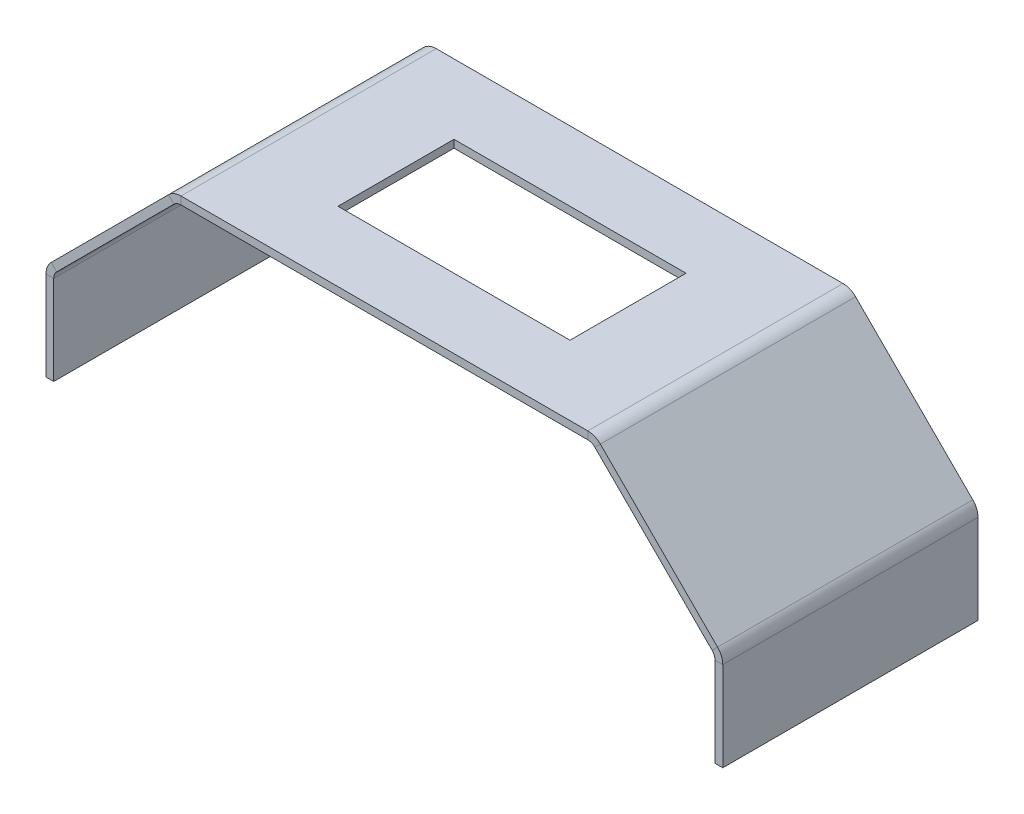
ISO-10303-21;
HEADER;
FILE_DESCRIPTION(('STEP AP214'),'2;1');
FILE_NAME('part.step','',(''),(''),'','','');
FILE_SCHEMA(('AUTOMOTIVE_DESIGN { 1 0 10303 214 1 1 1 1 }'));
ENDSEC;
DATA;
#1=APPLICATION_CONTEXT('core data for automotive mechanical design processes');
#2=APPLICATION_PROTOCOL_DEFINITION('international standard','automotive_design',2000,#1);
#3=PRODUCT_CONTEXT('',#1,'mechanical');
#4=PRODUCT('Part','Part','',(#3));
#5=PRODUCT_RELATED_PRODUCT_CATEGORY('part','',(#4));
#6=PRODUCT_DEFINITION_FORMATION('','',#4);
#7=PRODUCT_DEFINITION_CONTEXT('part definition',#1,'design');
#8=PRODUCT_DEFINITION('design','',#6,#7);
#9=PRODUCT_DEFINITION_SHAPE('','',#8);
#10=(LENGTH_UNIT() NAMED_UNIT(*) SI_UNIT(.MILLI.,.METRE.));
#11=(NAMED_UNIT(*) PLANE_ANGLE_UNIT() SI_UNIT($,.RADIAN.));
#12=(NAMED_UNIT(*) SI_UNIT($,.STERADIAN.) SOLID_ANGLE_UNIT());
#13=UNCERTAINTY_MEASURE_WITH_UNIT(LENGTH_MEASURE(1.E-05),#10,'distance_accuracy_value','');
#14=(GEOMETRIC_REPRESENTATION_CONTEXT(3) GLOBAL_UNCERTAINTY_ASSIGNED_CONTEXT((#13)) GLOBAL_UNIT_ASSIGNED_CONTEXT((#10,
#11,#12)) REPRESENTATION_CONTEXT('',''));
#15=CARTESIAN_POINT('',(0.,0.,0.));
#16=DIRECTION('',(0.,0.,1.));
#17=DIRECTION('',(1.,0.,0.));
#18=AXIS2_PLACEMENT_3D('',#15,#16,#17);
#19=CARTESIAN_POINT('',(1.34555144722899,26.345551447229,66.));
#20=DIRECTION('',(0.,0.,1.));
#21=DIRECTION('',(1.,0.,0.));
#22=AXIS2_PLACEMENT_3D('',#19,#20,#21);
#23=PLANE('',#22);
#24=DIRECTION('',(0.707106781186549,-0.707106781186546,0.));
#25=VECTOR('',#24,1.);
#26=CARTESIAN_POINT('',(1.34555144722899,26.345551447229,66.));
#27=LINE('',#26,#25);
#28=CARTESIAN_POINT('',(1.34555144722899,26.345551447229,66.));
#29=VERTEX_POINT('',#28);
#30=CARTESIAN_POINT('',(2.75976500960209,24.9313378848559,66.));
#31=VERTEX_POINT('',#30);
#32=EDGE_CURVE('E427',#29,#31,#27,.T.);
#33=ORIENTED_EDGE('',*,*,#32,.F.);
#34=CARTESIAN_POINT('',(4.594,23.097102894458,66.));
#35=DIRECTION('',(0.,0.,1.));
#36=DIRECTION('',(1.,0.,0.));
#37=AXIS2_PLACEMENT_3D('',#34,#35,#36);
#38=CIRCLE('',#37,4.594);
#39=CARTESIAN_POINT('',(0.,23.097102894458,66.));
#40=VERTEX_POINT('',#39);
#41=EDGE_CURVE('E250',#40,#29,#38,.F.);
#42=ORIENTED_EDGE('',*,*,#41,.F.);
#43=DIRECTION('',(-1.,0.,0.));
#44=VECTOR('',#43,1.);
#45=CARTESIAN_POINT('',(2.,23.097102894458,66.));
#46=LINE('',#45,#44);
#47=CARTESIAN_POINT('',(2.,23.097102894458,66.));
#48=VERTEX_POINT('',#47);
#49=EDGE_CURVE('E425',#48,#40,#46,.T.);
#50=ORIENTED_EDGE('',*,*,#49,.F.);
#51=CARTESIAN_POINT('',(4.594,23.097102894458,66.));
#52=DIRECTION('',(0.,0.,1.));
#53=DIRECTION('',(1.,0.,0.));
#54=AXIS2_PLACEMENT_3D('',#51,#52,#53);
#55=CIRCLE('',#54,2.594);
#56=EDGE_CURVE('E262',#48,#31,#55,.F.);
#57=ORIENTED_EDGE('',*,*,#56,.T.);
#58=EDGE_LOOP('',(#33,#42,#50,#57));
#59=FACE_BOUND('',#58,.T.);
#60=ADVANCED_FACE('F34',(#59),#23,.T.);
#61=CARTESIAN_POINT('',(2.,23.097102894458,66.));
#62=DIRECTION('',(0.,0.,1.));
#63=DIRECTION('',(1.,0.,0.));
#64=AXIS2_PLACEMENT_3D('',#61,#62,#63);
#65=PLANE('',#64);
#66=DIRECTION('',(0.707106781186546,0.707106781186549,0.));
#67=VECTOR('',#66,1.);
#68=CARTESIAN_POINT('',(0.,25.,66.));
#69=LINE('',#68,#67);
#70=CARTESIAN_POINT('',(31.6544485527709,56.654448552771,66.));
#71=VERTEX_POINT('',#70);
#72=EDGE_CURVE('E247',#29,#71,#69,.T.);
#73=ORIENTED_EDGE('',*,*,#72,.F.);
#74=ORIENTED_EDGE('',*,*,#32,.T.);
#75=DIRECTION('',(0.707106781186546,0.707106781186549,0.));
#76=VECTOR('',#75,1.);
#77=CARTESIAN_POINT('',(1.4142135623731,23.5857864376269,66.));
#78=LINE('',#77,#76);
#79=CARTESIAN_POINT('',(33.068662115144,55.2402349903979,66.));
#80=VERTEX_POINT('',#79);
#81=EDGE_CURVE('E265',#31,#80,#78,.T.);
#82=ORIENTED_EDGE('',*,*,#81,.T.);
#83=DIRECTION('',(-0.707106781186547,0.707106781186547,0.));
#84=VECTOR('',#83,1.);
#85=CARTESIAN_POINT('',(33.068662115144,55.2402349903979,66.));
#86=LINE('',#85,#84);
#87=EDGE_CURVE('E417',#80,#71,#86,.T.);
#88=ORIENTED_EDGE('',*,*,#87,.T.);
#89=EDGE_LOOP('',(#73,#74,#82,#88));
#90=FACE_BOUND('',#89,.T.);
#91=ADVANCED_FACE('F453',(#90),#65,.T.);
#92=CARTESIAN_POINT('',(0.,23.097102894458,0.));
#93=DIRECTION('',(0.,0.,-1.));
#94=DIRECTION('',(-1.,0.,0.));
#95=AXIS2_PLACEMENT_3D('',#92,#93,#94);
#96=PLANE('',#95);
#97=DIRECTION('',(1.,0.,0.));
#98=VECTOR('',#97,1.);
#99=CARTESIAN_POINT('',(0.,23.097102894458,0.));
#100=LINE('',#99,#98);
#101=CARTESIAN_POINT('',(0.,23.097102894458,0.));
#102=VERTEX_POINT('',#101);
#103=CARTESIAN_POINT('',(2.,23.097102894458,0.));
#104=VERTEX_POINT('',#103);
#105=EDGE_CURVE('E423',#102,#104,#100,.T.);
#106=ORIENTED_EDGE('',*,*,#105,.F.);
#107=CARTESIAN_POINT('',(4.594,23.097102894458,0.));
#108=DIRECTION('',(0.,0.,1.));
#109=DIRECTION('',(1.,0.,0.));
#110=AXIS2_PLACEMENT_3D('',#107,#108,#109);
#111=CIRCLE('',#110,4.594);
#112=CARTESIAN_POINT('',(1.34555144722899,26.345551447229,0.));
#113=VERTEX_POINT('',#112);
#114=EDGE_CURVE('E310',#102,#113,#111,.F.);
#115=ORIENTED_EDGE('',*,*,#114,.T.);
#116=DIRECTION('',(-0.707106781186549,0.707106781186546,0.));
#117=VECTOR('',#116,1.);
#118=CARTESIAN_POINT('',(2.75976500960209,24.9313378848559,0.));
#119=LINE('',#118,#117);
#120=CARTESIAN_POINT('',(2.75976500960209,24.9313378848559,0.));
#121=VERTEX_POINT('',#120);
#122=EDGE_CURVE('E421',#121,#113,#119,.T.);
#123=ORIENTED_EDGE('',*,*,#122,.F.);
#124=CARTESIAN_POINT('',(4.594,23.097102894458,0.));
#125=DIRECTION('',(0.,0.,1.));
#126=DIRECTION('',(1.,0.,0.));
#127=AXIS2_PLACEMENT_3D('',#124,#125,#126);
#128=CIRCLE('',#127,2.594);
#129=EDGE_CURVE('E322',#104,#121,#128,.F.);
#130=ORIENTED_EDGE('',*,*,#129,.F.);
#131=EDGE_LOOP('',(#106,#115,#123,#130));
#132=FACE_BOUND('',#131,.T.);
#133=ADVANCED_FACE('F458',(#132),#96,.T.);
#134=CARTESIAN_POINT('',(2.75976500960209,24.9313378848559,0.));
#135=DIRECTION('',(0.,0.,-1.));
#136=DIRECTION('',(-1.,0.,0.));
#137=AXIS2_PLACEMENT_3D('',#134,#135,#136);
#138=PLANE('',#137);
#139=DIRECTION('',(0.,1.,0.));
#140=VECTOR('',#139,1.);
#141=CARTESIAN_POINT('',(0.,0.,0.));
#142=LINE('',#141,#140);
#143=CARTESIAN_POINT('',(0.,0.,0.));
#144=VERTEX_POINT('',#143);
#145=EDGE_CURVE('E313',#144,#102,#142,.T.);
#146=ORIENTED_EDGE('',*,*,#145,.T.);
#147=ORIENTED_EDGE('',*,*,#105,.T.);
#148=DIRECTION('',(0.,1.,0.));
#149=VECTOR('',#148,1.);
#150=CARTESIAN_POINT('',(2.,0.,0.));
#151=LINE('',#150,#149);
#152=CARTESIAN_POINT('',(2.,0.,0.));
#153=VERTEX_POINT('',#152);
#154=EDGE_CURVE('E319',#153,#104,#151,.T.);
#155=ORIENTED_EDGE('',*,*,#154,.F.);
#156=DIRECTION('',(-1.,0.,0.));
#157=VECTOR('',#156,1.);
#158=CARTESIAN_POINT('',(2.,0.,0.));
#159=LINE('',#158,#157);
#160=EDGE_CURVE('E316',#153,#144,#159,.T.);
#161=ORIENTED_EDGE('',*,*,#160,.T.);
#162=EDGE_LOOP('',(#146,#147,#155,#161));
#163=FACE_BOUND('',#162,.T.);
#164=ADVANCED_FACE('F514',(#163),#138,.T.);
#165=CARTESIAN_POINT('',(34.9028971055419,58.,66.));
#166=DIRECTION('',(0.,0.,1.));
#167=DIRECTION('',(1.,0.,0.));
#168=AXIS2_PLACEMENT_3D('',#165,#166,#167);
#169=PLANE('',#168);
#170=DIRECTION('',(0.,-1.,0.));
#171=VECTOR('',#170,1.);
#172=CARTESIAN_POINT('',(34.9028971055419,58.,66.));
#173=LINE('',#172,#171);
#174=CARTESIAN_POINT('',(34.9028971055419,58.,66.));
#175=VERTEX_POINT('',#174);
#176=CARTESIAN_POINT('',(34.9028971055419,56.,66.));
#177=VERTEX_POINT('',#176);
#178=EDGE_CURVE('E419',#175,#177,#173,.T.);
#179=ORIENTED_EDGE('',*,*,#178,.F.);
#180=CARTESIAN_POINT('',(34.9028971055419,53.406,66.));
#181=DIRECTION('',(0.,0.,1.));
#182=DIRECTION('',(1.,0.,0.));
#183=AXIS2_PLACEMENT_3D('',#180,#181,#182);
#184=CIRCLE('',#183,4.594);
#185=EDGE_CURVE('E244',#71,#175,#184,.F.);
#186=ORIENTED_EDGE('',*,*,#185,.F.);
#187=ORIENTED_EDGE('',*,*,#87,.F.);
#188=CARTESIAN_POINT('',(34.9028971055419,53.406,66.));
#189=DIRECTION('',(0.,0.,1.));
#190=DIRECTION('',(1.,0.,0.));
#191=AXIS2_PLACEMENT_3D('',#188,#189,#190);
#192=CIRCLE('',#191,2.594);
#193=EDGE_CURVE('E268',#80,#177,#192,.F.);
#194=ORIENTED_EDGE('',*,*,#193,.T.);
#195=EDGE_LOOP('',(#179,#186,#187,#194));
#196=FACE_BOUND('',#195,.T.);
#197=ADVANCED_FACE('F502',(#196),#169,.T.);
#198=CARTESIAN_POINT('',(33.068662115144,55.2402349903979,66.));
#199=DIRECTION('',(0.,0.,1.));
#200=DIRECTION('',(1.,0.,0.));
#201=AXIS2_PLACEMENT_3D('',#198,#199,#200);
#202=PLANE('',#201);
#203=DIRECTION('',(1.,0.,0.));
#204=VECTOR('',#203,1.);
#205=CARTESIAN_POINT('',(32.9999999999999,58.,66.));
#206=LINE('',#205,#204);
#207=CARTESIAN_POINT('',(140.097102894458,58.,66.));
#208=VERTEX_POINT('',#207);
#209=EDGE_CURVE('E241',#175,#208,#206,.T.);
#210=ORIENTED_EDGE('',*,*,#209,.F.);
#211=ORIENTED_EDGE('',*,*,#178,.T.);
#212=DIRECTION('',(1.,0.,0.));
#213=VECTOR('',#212,1.);
#214=CARTESIAN_POINT('',(32.9999999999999,56.,66.));
#215=LINE('',#214,#213);
#216=CARTESIAN_POINT('',(140.097102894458,56.,66.));
#217=VERTEX_POINT('',#216);
#218=EDGE_CURVE('E271',#177,#217,#215,.T.);
#219=ORIENTED_EDGE('',*,*,#218,.T.);
#220=DIRECTION('',(0.,1.,0.));
#221=VECTOR('',#220,1.);
#222=CARTESIAN_POINT('',(140.097102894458,56.,66.));
#223=LINE('',#222,#221);
#224=EDGE_CURVE('E409',#217,#208,#223,.T.);
#225=ORIENTED_EDGE('',*,*,#224,.T.);
#226=EDGE_LOOP('',(#210,#211,#219,#225));
#227=FACE_BOUND('',#226,.T.);
#228=ADVANCED_FACE('F521',(#227),#202,.T.);
#229=CARTESIAN_POINT('',(31.6544485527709,56.654448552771,0.));
#230=DIRECTION('',(0.,0.,-1.));
#231=DIRECTION('',(-1.,0.,0.));
#232=AXIS2_PLACEMENT_3D('',#229,#230,#231);
#233=PLANE('',#232);
#234=DIRECTION('',(0.707106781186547,-0.707106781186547,0.));
#235=VECTOR('',#234,1.);
#236=CARTESIAN_POINT('',(31.6544485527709,56.654448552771,0.));
#237=LINE('',#236,#235);
#238=CARTESIAN_POINT('',(31.6544485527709,56.654448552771,0.));
#239=VERTEX_POINT('',#238);
#240=CARTESIAN_POINT('',(33.068662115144,55.2402349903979,0.));
#241=VERTEX_POINT('',#240);
#242=EDGE_CURVE('E415',#239,#241,#237,.T.);
#243=ORIENTED_EDGE('',*,*,#242,.F.);
#244=CARTESIAN_POINT('',(34.9028971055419,53.406,0.));
#245=DIRECTION('',(0.,0.,1.));
#246=DIRECTION('',(1.,0.,0.));
#247=AXIS2_PLACEMENT_3D('',#244,#245,#246);
#248=CIRCLE('',#247,4.594);
#249=CARTESIAN_POINT('',(34.9028971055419,58.,0.));
#250=VERTEX_POINT('',#249);
#251=EDGE_CURVE('E304',#239,#250,#248,.F.);
#252=ORIENTED_EDGE('',*,*,#251,.T.);
#253=DIRECTION('',(0.,1.,0.));
#254=VECTOR('',#253,1.);
#255=CARTESIAN_POINT('',(34.9028971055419,56.,0.));
#256=LINE('',#255,#254);
#257=CARTESIAN_POINT('',(34.9028971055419,56.,0.));
#258=VERTEX_POINT('',#257);
#259=EDGE_CURVE('E413',#258,#250,#256,.T.);
#260=ORIENTED_EDGE('',*,*,#259,.F.);
#261=CARTESIAN_POINT('',(34.9028971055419,53.406,0.));
#262=DIRECTION('',(0.,0.,1.));
#263=DIRECTION('',(1.,0.,0.));
#264=AXIS2_PLACEMENT_3D('',#261,#262,#263);
#265=CIRCLE('',#264,2.594);
#266=EDGE_CURVE('E328',#241,#258,#265,.F.);
#267=ORIENTED_EDGE('',*,*,#266,.F.);
#268=EDGE_LOOP('',(#243,#252,#260,#267));
#269=FACE_BOUND('',#268,.T.);
#270=ADVANCED_FACE('F527',(#269),#233,.T.);
#271=CARTESIAN_POINT('',(34.9028971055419,56.,0.));
#272=DIRECTION('',(0.,0.,-1.));
#273=DIRECTION('',(-1.,0.,0.));
#274=AXIS2_PLACEMENT_3D('',#271,#272,#273);
#275=PLANE('',#274);
#276=DIRECTION('',(0.707106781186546,0.707106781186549,0.));
#277=VECTOR('',#276,1.);
#278=CARTESIAN_POINT('',(0.,25.,0.));
#279=LINE('',#278,#277);
#280=EDGE_CURVE('E307',#113,#239,#279,.T.);
#281=ORIENTED_EDGE('',*,*,#280,.T.);
#282=ORIENTED_EDGE('',*,*,#242,.T.);
#283=DIRECTION('',(0.707106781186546,0.707106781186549,0.));
#284=VECTOR('',#283,1.);
#285=CARTESIAN_POINT('',(1.4142135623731,23.5857864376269,0.));
#286=LINE('',#285,#284);
#287=EDGE_CURVE('E325',#121,#241,#286,.T.);
#288=ORIENTED_EDGE('',*,*,#287,.F.);
#289=ORIENTED_EDGE('',*,*,#122,.T.);
#290=EDGE_LOOP('',(#281,#282,#288,#289));
#291=FACE_BOUND('',#290,.T.);
#292=ADVANCED_FACE('F511',(#291),#275,.T.);
#293=CARTESIAN_POINT('',(143.345551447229,56.654448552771,66.));
#294=DIRECTION('',(0.,0.,1.));
#295=DIRECTION('',(1.,0.,0.));
#296=AXIS2_PLACEMENT_3D('',#293,#294,#295);
#297=PLANE('',#296);
#298=DIRECTION('',(-0.707106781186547,-0.707106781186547,0.));
#299=VECTOR('',#298,1.);
#300=CARTESIAN_POINT('',(143.345551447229,56.654448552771,66.));
#301=LINE('',#300,#299);
#302=CARTESIAN_POINT('',(143.345551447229,56.654448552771,66.));
#303=VERTEX_POINT('',#302);
#304=CARTESIAN_POINT('',(141.931337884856,55.2402349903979,66.));
#305=VERTEX_POINT('',#304);
#306=EDGE_CURVE('E411',#303,#305,#301,.T.);
#307=ORIENTED_EDGE('',*,*,#306,.F.);
#308=CARTESIAN_POINT('',(140.097102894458,53.406,66.));
#309=DIRECTION('',(0.,0.,1.));
#310=DIRECTION('',(1.,0.,0.));
#311=AXIS2_PLACEMENT_3D('',#308,#309,#310);
#312=CIRCLE('',#311,4.594);
#313=EDGE_CURVE('E238',#208,#303,#312,.F.);
#314=ORIENTED_EDGE('',*,*,#313,.F.);
#315=ORIENTED_EDGE('',*,*,#224,.F.);
#316=CARTESIAN_POINT('',(140.097102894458,53.406,66.));
#317=DIRECTION('',(0.,0.,1.));
#318=DIRECTION('',(1.,0.,0.));
#319=AXIS2_PLACEMENT_3D('',#316,#317,#318);
#320=CIRCLE('',#319,2.594);
#321=EDGE_CURVE('E274',#217,#305,#320,.F.);
#322=ORIENTED_EDGE('',*,*,#321,.T.);
#323=EDGE_LOOP('',(#307,#314,#315,#322));
#324=FACE_BOUND('',#323,.T.);
#325=ADVANCED_FACE('F533',(#324),#297,.T.);
#326=CARTESIAN_POINT('',(140.097102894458,56.,66.));
#327=DIRECTION('',(0.,0.,1.));
#328=DIRECTION('',(1.,0.,0.));
#329=AXIS2_PLACEMENT_3D('',#326,#327,#328);
#330=PLANE('',#329);
#331=DIRECTION('',(0.707106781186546,-0.707106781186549,0.));
#332=VECTOR('',#331,1.);
#333=CARTESIAN_POINT('',(142.,58.,66.));
#334=LINE('',#333,#332);
#335=CARTESIAN_POINT('',(173.654448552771,26.345551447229,66.));
#336=VERTEX_POINT('',#335);
#337=EDGE_CURVE('E235',#303,#336,#334,.T.);
#338=ORIENTED_EDGE('',*,*,#337,.F.);
#339=ORIENTED_EDGE('',*,*,#306,.T.);
#340=DIRECTION('',(0.707106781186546,-0.707106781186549,0.));
#341=VECTOR('',#340,1.);
#342=CARTESIAN_POINT('',(140.585786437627,56.5857864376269,66.));
#343=LINE('',#342,#341);
#344=CARTESIAN_POINT('',(172.240234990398,24.9313378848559,66.));
#345=VERTEX_POINT('',#344);
#346=EDGE_CURVE('E277',#305,#345,#343,.T.);
#347=ORIENTED_EDGE('',*,*,#346,.T.);
#348=DIRECTION('',(0.707106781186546,0.707106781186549,0.));
#349=VECTOR('',#348,1.);
#350=CARTESIAN_POINT('',(172.240234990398,24.9313378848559,66.));
#351=LINE('',#350,#349);
#352=EDGE_CURVE('E401',#345,#336,#351,.T.);
#353=ORIENTED_EDGE('',*,*,#352,.T.);
#354=EDGE_LOOP('',(#338,#339,#347,#353));
#355=FACE_BOUND('',#354,.T.);
#356=ADVANCED_FACE('F536',(#355),#330,.T.);
#357=CARTESIAN_POINT('',(140.097102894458,58.,0.));
#358=DIRECTION('',(0.,0.,-1.));
#359=DIRECTION('',(-1.,0.,0.));
#360=AXIS2_PLACEMENT_3D('',#357,#358,#359);
#361=PLANE('',#360);
#362=DIRECTION('',(0.,-1.,0.));
#363=VECTOR('',#362,1.);
#364=CARTESIAN_POINT('',(140.097102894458,58.,0.));
#365=LINE('',#364,#363);
#366=CARTESIAN_POINT('',(140.097102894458,58.,0.));
#367=VERTEX_POINT('',#366);
#368=CARTESIAN_POINT('',(140.097102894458,56.,0.));
#369=VERTEX_POINT('',#368);
#370=EDGE_CURVE('E407',#367,#369,#365,.T.);
#371=ORIENTED_EDGE('',*,*,#370,.F.);
#372=CARTESIAN_POINT('',(140.097102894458,53.406,0.));
#373=DIRECTION('',(0.,0.,1.));
#374=DIRECTION('',(1.,0.,0.));
#375=AXIS2_PLACEMENT_3D('',#372,#373,#374);
#376=CIRCLE('',#375,4.594);
#377=CARTESIAN_POINT('',(143.345551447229,56.654448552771,0.));
#378=VERTEX_POINT('',#377);
#379=EDGE_CURVE('E298',#367,#378,#376,.F.);
#380=ORIENTED_EDGE('',*,*,#379,.T.);
#381=DIRECTION('',(0.707106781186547,0.707106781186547,0.));
#382=VECTOR('',#381,1.);
#383=CARTESIAN_POINT('',(141.931337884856,55.2402349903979,0.));
#384=LINE('',#383,#382);
#385=CARTESIAN_POINT('',(141.931337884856,55.2402349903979,0.));
#386=VERTEX_POINT('',#385);
#387=EDGE_CURVE('E405',#386,#378,#384,.T.);
#388=ORIENTED_EDGE('',*,*,#387,.F.);
#389=CARTESIAN_POINT('',(140.097102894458,53.406,0.));
#390=DIRECTION('',(0.,0.,1.));
#391=DIRECTION('',(1.,0.,0.));
#392=AXIS2_PLACEMENT_3D('',#389,#390,#391);
#393=CIRCLE('',#392,2.594);
#394=EDGE_CURVE('E334',#369,#386,#393,.F.);
#395=ORIENTED_EDGE('',*,*,#394,.F.);
#396=EDGE_LOOP('',(#371,#380,#388,#395));
#397=FACE_BOUND('',#396,.T.);
#398=ADVANCED_FACE('F540',(#397),#361,.T.);
#399=CARTESIAN_POINT('',(141.931337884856,55.2402349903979,0.));
#400=DIRECTION('',(0.,0.,-1.));
#401=DIRECTION('',(-1.,0.,0.));
#402=AXIS2_PLACEMENT_3D('',#399,#400,#401);
#403=PLANE('',#402);
#404=DIRECTION('',(1.,0.,0.));
#405=VECTOR('',#404,1.);
#406=CARTESIAN_POINT('',(32.9999999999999,58.,0.));
#407=LINE('',#406,#405);
#408=EDGE_CURVE('E301',#250,#367,#407,.T.);
#409=ORIENTED_EDGE('',*,*,#408,.T.);
#410=ORIENTED_EDGE('',*,*,#370,.T.);
#411=DIRECTION('',(1.,0.,0.));
#412=VECTOR('',#411,1.);
#413=CARTESIAN_POINT('',(32.9999999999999,56.,0.));
#414=LINE('',#413,#412);
#415=EDGE_CURVE('E331',#258,#369,#414,.T.);
#416=ORIENTED_EDGE('',*,*,#415,.F.);
#417=ORIENTED_EDGE('',*,*,#259,.T.);
#418=EDGE_LOOP('',(#409,#410,#416,#417));
#419=FACE_BOUND('',#418,.T.);
#420=ADVANCED_FACE('F544',(#419),#403,.T.);
#421=CARTESIAN_POINT('',(175.,23.097102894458,66.));
#422=DIRECTION('',(0.,0.,1.));
#423=DIRECTION('',(1.,0.,0.));
#424=AXIS2_PLACEMENT_3D('',#421,#422,#423);
#425=PLANE('',#424);
#426=DIRECTION('',(-1.,0.,0.));
#427=VECTOR('',#426,1.);
#428=CARTESIAN_POINT('',(175.,23.097102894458,66.));
#429=LINE('',#428,#427);
#430=CARTESIAN_POINT('',(175.,23.097102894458,66.));
#431=VERTEX_POINT('',#430);
#432=CARTESIAN_POINT('',(173.,23.097102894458,66.));
#433=VERTEX_POINT('',#432);
#434=EDGE_CURVE('E403',#431,#433,#429,.T.);
#435=ORIENTED_EDGE('',*,*,#434,.F.);
#436=CARTESIAN_POINT('',(170.406,23.097102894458,66.));
#437=DIRECTION('',(0.,0.,1.));
#438=DIRECTION('',(1.,0.,0.));
#439=AXIS2_PLACEMENT_3D('',#436,#437,#438);
#440=CIRCLE('',#439,4.594);
#441=EDGE_CURVE('E232',#336,#431,#440,.F.);
#442=ORIENTED_EDGE('',*,*,#441,.F.);
#443=ORIENTED_EDGE('',*,*,#352,.F.);
#444=CARTESIAN_POINT('',(170.406,23.097102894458,66.));
#445=DIRECTION('',(0.,0.,1.));
#446=DIRECTION('',(1.,0.,0.));
#447=AXIS2_PLACEMENT_3D('',#444,#445,#446);
#448=CIRCLE('',#447,2.594);
#449=EDGE_CURVE('E280',#345,#433,#448,.F.);
#450=ORIENTED_EDGE('',*,*,#449,.T.);
#451=EDGE_LOOP('',(#435,#442,#443,#450));
#452=FACE_BOUND('',#451,.T.);
#453=ADVANCED_FACE('F548',(#452),#425,.T.);
#454=CARTESIAN_POINT('',(172.240234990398,24.9313378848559,66.));
#455=DIRECTION('',(0.,0.,1.));
#456=DIRECTION('',(1.,0.,0.));
#457=AXIS2_PLACEMENT_3D('',#454,#455,#456);
#458=PLANE('',#457);
#459=DIRECTION('',(0.,-1.,0.));
#460=VECTOR('',#459,1.);
#461=CARTESIAN_POINT('',(175.,25.,66.));
#462=LINE('',#461,#460);
#463=CARTESIAN_POINT('',(175.,0.,66.));
#464=VERTEX_POINT('',#463);
#465=EDGE_CURVE('E229',#431,#464,#462,.T.);
#466=ORIENTED_EDGE('',*,*,#465,.F.);
#467=ORIENTED_EDGE('',*,*,#434,.T.);
#468=DIRECTION('',(0.,1.,0.));
#469=VECTOR('',#468,1.);
#470=CARTESIAN_POINT('',(173.,25.,66.));
#471=LINE('',#470,#469);
#472=CARTESIAN_POINT('',(173.,0.,66.));
#473=VERTEX_POINT('',#472);
#474=EDGE_CURVE('E223',#433,#473,#471,.F.);
#475=ORIENTED_EDGE('',*,*,#474,.T.);
#476=DIRECTION('',(-1.,0.,0.));
#477=VECTOR('',#476,1.);
#478=CARTESIAN_POINT('',(175.,0.,66.));
#479=LINE('',#478,#477);
#480=EDGE_CURVE('E225',#464,#473,#479,.T.);
#481=ORIENTED_EDGE('',*,*,#480,.F.);
#482=EDGE_LOOP('',(#466,#467,#475,#481));
#483=FACE_BOUND('',#482,.T.);
#484=ADVANCED_FACE('F552',(#483),#458,.T.);
#485=CARTESIAN_POINT('',(173.654448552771,26.345551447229,0.));
#486=DIRECTION('',(0.,0.,-1.));
#487=DIRECTION('',(-1.,0.,0.));
#488=AXIS2_PLACEMENT_3D('',#485,#486,#487);
#489=PLANE('',#488);
#490=DIRECTION('',(-0.707106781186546,-0.707106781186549,0.));
#491=VECTOR('',#490,1.);
#492=CARTESIAN_POINT('',(173.654448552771,26.345551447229,0.));
#493=LINE('',#492,#491);
#494=CARTESIAN_POINT('',(173.654448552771,26.345551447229,0.));
#495=VERTEX_POINT('',#494);
#496=CARTESIAN_POINT('',(172.240234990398,24.9313378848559,0.));
#497=VERTEX_POINT('',#496);
#498=EDGE_CURVE('E399',#495,#497,#493,.T.);
#499=ORIENTED_EDGE('',*,*,#498,.F.);
#500=CARTESIAN_POINT('',(170.406,23.097102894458,0.));
#501=DIRECTION('',(0.,0.,1.));
#502=DIRECTION('',(1.,0.,0.));
#503=AXIS2_PLACEMENT_3D('',#500,#501,#502);
#504=CIRCLE('',#503,4.594);
#505=CARTESIAN_POINT('',(175.,23.097102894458,0.));
#506=VERTEX_POINT('',#505);
#507=EDGE_CURVE('E292',#495,#506,#504,.F.);
#508=ORIENTED_EDGE('',*,*,#507,.T.);
#509=DIRECTION('',(1.,0.,0.));
#510=VECTOR('',#509,1.);
#511=CARTESIAN_POINT('',(173.,23.097102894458,0.));
#512=LINE('',#511,#510);
#513=CARTESIAN_POINT('',(173.,23.097102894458,0.));
#514=VERTEX_POINT('',#513);
#515=EDGE_CURVE('E397',#514,#506,#512,.T.);
#516=ORIENTED_EDGE('',*,*,#515,.F.);
#517=CARTESIAN_POINT('',(170.406,23.097102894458,0.));
#518=DIRECTION('',(0.,0.,1.));
#519=DIRECTION('',(1.,0.,0.));
#520=AXIS2_PLACEMENT_3D('',#517,#518,#519);
#521=CIRCLE('',#520,2.594);
#522=EDGE_CURVE('E226',#497,#514,#521,.F.);
#523=ORIENTED_EDGE('',*,*,#522,.F.);
#524=EDGE_LOOP('',(#499,#508,#516,#523));
#525=FACE_BOUND('',#524,.T.);
#526=ADVANCED_FACE('F556',(#525),#489,.T.);
#527=CARTESIAN_POINT('',(173.,23.097102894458,0.));
#528=DIRECTION('',(0.,0.,-1.));
#529=DIRECTION('',(-1.,0.,0.));
#530=AXIS2_PLACEMENT_3D('',#527,#528,#529);
#531=PLANE('',#530);
#532=DIRECTION('',(0.707106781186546,-0.707106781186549,0.));
#533=VECTOR('',#532,1.);
#534=CARTESIAN_POINT('',(142.,58.,0.));
#535=LINE('',#534,#533);
#536=EDGE_CURVE('E295',#378,#495,#535,.T.);
#537=ORIENTED_EDGE('',*,*,#536,.T.);
#538=ORIENTED_EDGE('',*,*,#498,.T.);
#539=DIRECTION('',(0.707106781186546,-0.707106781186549,0.));
#540=VECTOR('',#539,1.);
#541=CARTESIAN_POINT('',(140.585786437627,56.5857864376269,0.));
#542=LINE('',#541,#540);
#543=EDGE_CURVE('E337',#386,#497,#542,.T.);
#544=ORIENTED_EDGE('',*,*,#543,.F.);
#545=ORIENTED_EDGE('',*,*,#387,.T.);
#546=EDGE_LOOP('',(#537,#538,#544,#545));
#547=FACE_BOUND('',#546,.T.);
#548=ADVANCED_FACE('F560',(#547),#531,.T.);
#549=CARTESIAN_POINT('',(173.,25.,66.));
#550=DIRECTION('',(1.,0.,0.));
#551=DIRECTION('',(0.,0.,-1.));
#552=AXIS2_PLACEMENT_3D('',#549,#550,#551);
#553=PLANE('',#552);
#554=DIRECTION('',(0.,1.,0.));
#555=VECTOR('',#554,1.);
#556=CARTESIAN_POINT('',(173.,25.,0.));
#557=LINE('',#556,#555);
#558=CARTESIAN_POINT('',(173.,0.,0.));
#559=VERTEX_POINT('',#558);
#560=EDGE_CURVE('E220',#514,#559,#557,.F.);
#561=ORIENTED_EDGE('',*,*,#560,.T.);
#562=DIRECTION('',(0.,0.,-1.));
#563=VECTOR('',#562,1.);
#564=CARTESIAN_POINT('',(173.,0.,66.));
#565=LINE('',#564,#563);
#566=EDGE_CURVE('E395',#473,#559,#565,.T.);
#567=ORIENTED_EDGE('',*,*,#566,.F.);
#568=ORIENTED_EDGE('',*,*,#474,.F.);
#569=DIRECTION('',(0.,0.,-1.));
#570=VECTOR('',#569,1.);
#571=CARTESIAN_POINT('',(173.,23.097102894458,66.));
#572=LINE('',#571,#570);
#573=EDGE_CURVE('E283',#433,#514,#572,.T.);
#574=ORIENTED_EDGE('',*,*,#573,.T.);
#575=EDGE_LOOP('',(#561,#567,#568,#574));
#576=FACE_BOUND('',#575,.T.);
#577=ADVANCED_FACE('F564',(#576),#553,.F.);
#578=CARTESIAN_POINT('',(175.,0.,66.));
#579=DIRECTION('',(0.,-1.,0.));
#580=DIRECTION('',(0.,0.,-1.));
#581=AXIS2_PLACEMENT_3D('',#578,#579,#580);
#582=PLANE('',#581);
#583=DIRECTION('',(-1.,0.,0.));
#584=VECTOR('',#583,1.);
#585=CARTESIAN_POINT('',(175.,0.,0.));
#586=LINE('',#585,#584);
#587=CARTESIAN_POINT('',(175.,0.,0.));
#588=VERTEX_POINT('',#587);
#589=EDGE_CURVE('E286',#588,#559,#586,.T.);
#590=ORIENTED_EDGE('',*,*,#589,.F.);
#591=DIRECTION('',(0.,0.,-1.));
#592=VECTOR('',#591,1.);
#593=CARTESIAN_POINT('',(175.,0.,66.));
#594=LINE('',#593,#592);
#595=EDGE_CURVE('E393',#464,#588,#594,.T.);
#596=ORIENTED_EDGE('',*,*,#595,.F.);
#597=ORIENTED_EDGE('',*,*,#480,.T.);
#598=ORIENTED_EDGE('',*,*,#566,.T.);
#599=EDGE_LOOP('',(#590,#596,#597,#598));
#600=FACE_BOUND('',#599,.T.);
#601=ADVANCED_FACE('F568',(#600),#582,.T.);
#602=CARTESIAN_POINT('',(175.,25.,66.));
#603=DIRECTION('',(1.,0.,0.));
#604=DIRECTION('',(0.,0.,-1.));
#605=AXIS2_PLACEMENT_3D('',#602,#603,#604);
#606=PLANE('',#605);
#607=DIRECTION('',(0.,-1.,0.));
#608=VECTOR('',#607,1.);
#609=CARTESIAN_POINT('',(175.,25.,0.));
#610=LINE('',#609,#608);
#611=EDGE_CURVE('E289',#506,#588,#610,.T.);
#612=ORIENTED_EDGE('',*,*,#611,.F.);
#613=DIRECTION('',(0.,0.,-1.));
#614=VECTOR('',#613,1.);
#615=CARTESIAN_POINT('',(175.,23.097102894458,66.));
#616=LINE('',#615,#614);
#617=EDGE_CURVE('E390',#431,#506,#616,.T.);
#618=ORIENTED_EDGE('',*,*,#617,.F.);
#619=ORIENTED_EDGE('',*,*,#465,.T.);
#620=ORIENTED_EDGE('',*,*,#595,.T.);
#621=EDGE_LOOP('',(#612,#618,#619,#620));
#622=FACE_BOUND('',#621,.T.);
#623=ADVANCED_FACE('F572',(#622),#606,.T.);
#624=CARTESIAN_POINT('',(170.406,23.097102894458,66.));
#625=DIRECTION('',(0.,0.,-1.));
#626=DIRECTION('',(-1.,0.,0.));
#627=AXIS2_PLACEMENT_3D('',#624,#625,#626);
#628=CYLINDRICAL_SURFACE('',#627,4.594);
#629=ORIENTED_EDGE('',*,*,#507,.F.);
#630=DIRECTION('',(0.,0.,-1.));
#631=VECTOR('',#630,1.);
#632=CARTESIAN_POINT('',(173.654448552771,26.345551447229,66.));
#633=LINE('',#632,#631);
#634=EDGE_CURVE('E387',#336,#495,#633,.T.);
#635=ORIENTED_EDGE('',*,*,#634,.F.);
#636=ORIENTED_EDGE('',*,*,#441,.T.);
#637=ORIENTED_EDGE('',*,*,#617,.T.);
#638=EDGE_LOOP('',(#629,#635,#636,#637));
#639=FACE_BOUND('',#638,.T.);
#640=ADVANCED_FACE('F576',(#639),#628,.T.);
#641=CARTESIAN_POINT('',(142.,58.,66.));
#642=DIRECTION('',(0.707106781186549,0.707106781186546,0.));
#643=DIRECTION('',(-0.707106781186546,0.707106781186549,0.));
#644=AXIS2_PLACEMENT_3D('',#641,#642,#643);
#645=PLANE('',#644);
#646=ORIENTED_EDGE('',*,*,#536,.F.);
#647=DIRECTION('',(0.,0.,-1.));
#648=VECTOR('',#647,1.);
#649=CARTESIAN_POINT('',(143.345551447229,56.654448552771,66.));
#650=LINE('',#649,#648);
#651=EDGE_CURVE('E384',#303,#378,#650,.T.);
#652=ORIENTED_EDGE('',*,*,#651,.F.);
#653=ORIENTED_EDGE('',*,*,#337,.T.);
#654=ORIENTED_EDGE('',*,*,#634,.T.);
#655=EDGE_LOOP('',(#646,#652,#653,#654));
#656=FACE_BOUND('',#655,.T.);
#657=ADVANCED_FACE('F580',(#656),#645,.T.);
#658=CARTESIAN_POINT('',(140.097102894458,53.406,66.));
#659=DIRECTION('',(0.,0.,-1.));
#660=DIRECTION('',(-1.,0.,0.));
#661=AXIS2_PLACEMENT_3D('',#658,#659,#660);
#662=CYLINDRICAL_SURFACE('',#661,4.594);
#663=ORIENTED_EDGE('',*,*,#379,.F.);
#664=DIRECTION('',(0.,0.,-1.));
#665=VECTOR('',#664,1.);
#666=CARTESIAN_POINT('',(140.097102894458,58.,66.));
#667=LINE('',#666,#665);
#668=EDGE_CURVE('E381',#208,#367,#667,.T.);
#669=ORIENTED_EDGE('',*,*,#668,.F.);
#670=ORIENTED_EDGE('',*,*,#313,.T.);
#671=ORIENTED_EDGE('',*,*,#651,.T.);
#672=EDGE_LOOP('',(#663,#669,#670,#671));
#673=FACE_BOUND('',#672,.T.);
#674=ADVANCED_FACE('F584',(#673),#662,.T.);
#675=CARTESIAN_POINT('',(32.9999999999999,58.,66.));
#676=DIRECTION('',(0.,1.,0.));
#677=DIRECTION('',(-1.,0.,0.));
#678=AXIS2_PLACEMENT_3D('',#675,#676,#677);
#679=PLANE('',#678);
#680=DIRECTION('',(0.,0.,1.));
#681=VECTOR('',#680,1.);
#682=CARTESIAN_POINT('',(57.5,58.,18.));
#683=LINE('',#682,#681);
#684=CARTESIAN_POINT('',(57.5,58.,18.));
#685=VERTEX_POINT('',#684);
#686=CARTESIAN_POINT('',(57.5,58.,48.));
#687=VERTEX_POINT('',#686);
#688=EDGE_CURVE('E48',#685,#687,#683,.T.);
#689=ORIENTED_EDGE('',*,*,#688,.F.);
#690=DIRECTION('',(-1.,0.,0.));
#691=VECTOR('',#690,1.);
#692=CARTESIAN_POINT('',(57.5,58.,18.));
#693=LINE('',#692,#691);
#694=CARTESIAN_POINT('',(117.5,58.,18.));
#695=VERTEX_POINT('',#694);
#696=EDGE_CURVE('E213',#695,#685,#693,.T.);
#697=ORIENTED_EDGE('',*,*,#696,.F.);
#698=DIRECTION('',(0.,0.,-1.));
#699=VECTOR('',#698,1.);
#700=CARTESIAN_POINT('',(117.5,58.,18.));
#701=LINE('',#700,#699);
#702=CARTESIAN_POINT('',(117.5,58.,48.));
#703=VERTEX_POINT('',#702);
#704=EDGE_CURVE('E197',#703,#695,#701,.T.);
#705=ORIENTED_EDGE('',*,*,#704,.F.);
#706=DIRECTION('',(1.,0.,0.));
#707=VECTOR('',#706,1.);
#708=CARTESIAN_POINT('',(57.5,58.,48.));
#709=LINE('',#708,#707);
#710=EDGE_CURVE('E206',#687,#703,#709,.T.);
#711=ORIENTED_EDGE('',*,*,#710,.F.);
#712=EDGE_LOOP('',(#689,#697,#705,#711));
#713=FACE_BOUND('',#712,.T.);
#714=ORIENTED_EDGE('',*,*,#408,.F.);
#715=DIRECTION('',(0.,0.,-1.));
#716=VECTOR('',#715,1.);
#717=CARTESIAN_POINT('',(34.9028971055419,58.,66.));
#718=LINE('',#717,#716);
#719=EDGE_CURVE('E378',#175,#250,#718,.T.);
#720=ORIENTED_EDGE('',*,*,#719,.F.);
#721=ORIENTED_EDGE('',*,*,#209,.T.);
#722=ORIENTED_EDGE('',*,*,#668,.T.);
#723=EDGE_LOOP('',(#714,#720,#721,#722));
#724=FACE_BOUND('',#723,.T.);
#725=ADVANCED_FACE('F210',(#713,#724),#679,.T.);
#726=CARTESIAN_POINT('',(34.9028971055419,53.406,66.));
#727=DIRECTION('',(0.,0.,-1.));
#728=DIRECTION('',(-1.,0.,0.));
#729=AXIS2_PLACEMENT_3D('',#726,#727,#728);
#730=CYLINDRICAL_SURFACE('',#729,4.594);
#731=ORIENTED_EDGE('',*,*,#251,.F.);
#732=DIRECTION('',(0.,0.,-1.));
#733=VECTOR('',#732,1.);
#734=CARTESIAN_POINT('',(31.6544485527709,56.654448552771,66.));
#735=LINE('',#734,#733);
#736=EDGE_CURVE('E375',#71,#239,#735,.T.);
#737=ORIENTED_EDGE('',*,*,#736,.F.);
#738=ORIENTED_EDGE('',*,*,#185,.T.);
#739=ORIENTED_EDGE('',*,*,#719,.T.);
#740=EDGE_LOOP('',(#731,#737,#738,#739));
#741=FACE_BOUND('',#740,.T.);
#742=ADVANCED_FACE('F507',(#741),#730,.T.);
#743=CARTESIAN_POINT('',(0.,25.,66.));
#744=DIRECTION('',(-0.707106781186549,0.707106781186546,0.));
#745=DIRECTION('',(-0.707106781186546,-0.707106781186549,0.));
#746=AXIS2_PLACEMENT_3D('',#743,#744,#745);
#747=PLANE('',#746);
#748=ORIENTED_EDGE('',*,*,#280,.F.);
#749=DIRECTION('',(0.,0.,-1.));
#750=VECTOR('',#749,1.);
#751=CARTESIAN_POINT('',(1.34555144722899,26.345551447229,66.));
#752=LINE('',#751,#750);
#753=EDGE_CURVE('E372',#29,#113,#752,.T.);
#754=ORIENTED_EDGE('',*,*,#753,.F.);
#755=ORIENTED_EDGE('',*,*,#72,.T.);
#756=ORIENTED_EDGE('',*,*,#736,.T.);
#757=EDGE_LOOP('',(#748,#754,#755,#756));
#758=FACE_BOUND('',#757,.T.);
#759=ADVANCED_FACE('F467',(#758),#747,.T.);
#760=CARTESIAN_POINT('',(4.594,23.097102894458,66.));
#761=DIRECTION('',(0.,0.,-1.));
#762=DIRECTION('',(-1.,0.,0.));
#763=AXIS2_PLACEMENT_3D('',#760,#761,#762);
#764=CYLINDRICAL_SURFACE('',#763,4.594);
#765=ORIENTED_EDGE('',*,*,#114,.F.);
#766=DIRECTION('',(0.,0.,-1.));
#767=VECTOR('',#766,1.);
#768=CARTESIAN_POINT('',(0.,23.097102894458,66.));
#769=LINE('',#768,#767);
#770=EDGE_CURVE('E369',#40,#102,#769,.T.);
#771=ORIENTED_EDGE('',*,*,#770,.F.);
#772=ORIENTED_EDGE('',*,*,#41,.T.);
#773=ORIENTED_EDGE('',*,*,#753,.T.);
#774=EDGE_LOOP('',(#765,#771,#772,#773));
#775=FACE_BOUND('',#774,.T.);
#776=ADVANCED_FACE('F472',(#775),#764,.T.);
#777=CARTESIAN_POINT('',(0.,0.,66.));
#778=DIRECTION('',(-1.,0.,0.));
#779=DIRECTION('',(0.,0.,1.));
#780=AXIS2_PLACEMENT_3D('',#777,#778,#779);
#781=PLANE('',#780);
#782=ORIENTED_EDGE('',*,*,#145,.F.);
#783=DIRECTION('',(0.,0.,-1.));
#784=VECTOR('',#783,1.);
#785=CARTESIAN_POINT('',(0.,0.,66.));
#786=LINE('',#785,#784);
#787=CARTESIAN_POINT('',(0.,0.,66.));
#788=VERTEX_POINT('',#787);
#789=EDGE_CURVE('E367',#788,#144,#786,.T.);
#790=ORIENTED_EDGE('',*,*,#789,.F.);
#791=DIRECTION('',(0.,1.,0.));
#792=VECTOR('',#791,1.);
#793=CARTESIAN_POINT('',(0.,0.,66.));
#794=LINE('',#793,#792);
#795=EDGE_CURVE('E253',#788,#40,#794,.T.);
#796=ORIENTED_EDGE('',*,*,#795,.T.);
#797=ORIENTED_EDGE('',*,*,#770,.T.);
#798=EDGE_LOOP('',(#782,#790,#796,#797));
#799=FACE_BOUND('',#798,.T.);
#800=ADVANCED_FACE('F475',(#799),#781,.T.);
#801=CARTESIAN_POINT('',(2.,0.,66.));
#802=DIRECTION('',(0.,-1.,0.));
#803=DIRECTION('',(0.,0.,-1.));
#804=AXIS2_PLACEMENT_3D('',#801,#802,#803);
#805=PLANE('',#804);
#806=ORIENTED_EDGE('',*,*,#160,.F.);
#807=DIRECTION('',(0.,0.,-1.));
#808=VECTOR('',#807,1.);
#809=CARTESIAN_POINT('',(2.,0.,66.));
#810=LINE('',#809,#808);
#811=CARTESIAN_POINT('',(2.,0.,66.));
#812=VERTEX_POINT('',#811);
#813=EDGE_CURVE('E365',#812,#153,#810,.T.);
#814=ORIENTED_EDGE('',*,*,#813,.F.);
#815=DIRECTION('',(-1.,0.,0.));
#816=VECTOR('',#815,1.);
#817=CARTESIAN_POINT('',(2.,0.,66.));
#818=LINE('',#817,#816);
#819=EDGE_CURVE('E256',#812,#788,#818,.T.);
#820=ORIENTED_EDGE('',*,*,#819,.T.);
#821=ORIENTED_EDGE('',*,*,#789,.T.);
#822=EDGE_LOOP('',(#806,#814,#820,#821));
#823=FACE_BOUND('',#822,.T.);
#824=ADVANCED_FACE('F481',(#823),#805,.T.);
#825=CARTESIAN_POINT('',(2.,0.,66.));
#826=DIRECTION('',(-1.,0.,0.));
#827=DIRECTION('',(0.,0.,1.));
#828=AXIS2_PLACEMENT_3D('',#825,#826,#827);
#829=PLANE('',#828);
#830=ORIENTED_EDGE('',*,*,#154,.T.);
#831=DIRECTION('',(0.,0.,-1.));
#832=VECTOR('',#831,1.);
#833=CARTESIAN_POINT('',(2.,23.097102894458,66.));
#834=LINE('',#833,#832);
#835=EDGE_CURVE('E362',#48,#104,#834,.T.);
#836=ORIENTED_EDGE('',*,*,#835,.F.);
#837=DIRECTION('',(0.,1.,0.));
#838=VECTOR('',#837,1.);
#839=CARTESIAN_POINT('',(2.,0.,66.));
#840=LINE('',#839,#838);
#841=EDGE_CURVE('E259',#812,#48,#840,.T.);
#842=ORIENTED_EDGE('',*,*,#841,.F.);
#843=ORIENTED_EDGE('',*,*,#813,.T.);
#844=EDGE_LOOP('',(#830,#836,#842,#843));
#845=FACE_BOUND('',#844,.T.);
#846=ADVANCED_FACE('F486',(#845),#829,.F.);
#847=CARTESIAN_POINT('',(4.594,23.097102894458,66.));
#848=DIRECTION('',(0.,0.,-1.));
#849=DIRECTION('',(-1.,0.,0.));
#850=AXIS2_PLACEMENT_3D('',#847,#848,#849);
#851=CYLINDRICAL_SURFACE('',#850,2.594);
#852=ORIENTED_EDGE('',*,*,#129,.T.);
#853=DIRECTION('',(0.,0.,-1.));
#854=VECTOR('',#853,1.);
#855=CARTESIAN_POINT('',(2.75976500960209,24.9313378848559,66.));
#856=LINE('',#855,#854);
#857=EDGE_CURVE('E359',#31,#121,#856,.T.);
#858=ORIENTED_EDGE('',*,*,#857,.F.);
#859=ORIENTED_EDGE('',*,*,#56,.F.);
#860=ORIENTED_EDGE('',*,*,#835,.T.);
#861=EDGE_LOOP('',(#852,#858,#859,#860));
#862=FACE_BOUND('',#861,.T.);
#863=ADVANCED_FACE('F489',(#862),#851,.F.);
#864=CARTESIAN_POINT('',(1.4142135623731,23.5857864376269,66.));
#865=DIRECTION('',(-0.707106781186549,0.707106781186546,0.));
#866=DIRECTION('',(-0.707106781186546,-0.707106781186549,0.));
#867=AXIS2_PLACEMENT_3D('',#864,#865,#866);
#868=PLANE('',#867);
#869=ORIENTED_EDGE('',*,*,#287,.T.);
#870=DIRECTION('',(0.,0.,-1.));
#871=VECTOR('',#870,1.);
#872=CARTESIAN_POINT('',(33.068662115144,55.2402349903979,66.));
#873=LINE('',#872,#871);
#874=EDGE_CURVE('E356',#80,#241,#873,.T.);
#875=ORIENTED_EDGE('',*,*,#874,.F.);
#876=ORIENTED_EDGE('',*,*,#81,.F.);
#877=ORIENTED_EDGE('',*,*,#857,.T.);
#878=EDGE_LOOP('',(#869,#875,#876,#877));
#879=FACE_BOUND('',#878,.T.);
#880=ADVANCED_FACE('F494',(#879),#868,.F.);
#881=CARTESIAN_POINT('',(34.9028971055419,53.406,66.));
#882=DIRECTION('',(0.,0.,-1.));
#883=DIRECTION('',(-1.,0.,0.));
#884=AXIS2_PLACEMENT_3D('',#881,#882,#883);
#885=CYLINDRICAL_SURFACE('',#884,2.594);
#886=ORIENTED_EDGE('',*,*,#266,.T.);
#887=DIRECTION('',(0.,0.,-1.));
#888=VECTOR('',#887,1.);
#889=CARTESIAN_POINT('',(34.9028971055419,56.,66.));
#890=LINE('',#889,#888);
#891=EDGE_CURVE('E353',#177,#258,#890,.T.);
#892=ORIENTED_EDGE('',*,*,#891,.F.);
#893=ORIENTED_EDGE('',*,*,#193,.F.);
#894=ORIENTED_EDGE('',*,*,#874,.T.);
#895=EDGE_LOOP('',(#886,#892,#893,#894));
#896=FACE_BOUND('',#895,.T.);
#897=ADVANCED_FACE('F499',(#896),#885,.F.);
#898=CARTESIAN_POINT('',(32.9999999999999,56.,66.));
#899=DIRECTION('',(0.,1.,0.));
#900=DIRECTION('',(-1.,0.,0.));
#901=AXIS2_PLACEMENT_3D('',#898,#899,#900);
#902=PLANE('',#901);
#903=DIRECTION('',(-1.,0.,0.));
#904=VECTOR('',#903,1.);
#905=CARTESIAN_POINT('',(32.9999999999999,56.,18.));
#906=LINE('',#905,#904);
#907=CARTESIAN_POINT('',(117.5,56.,18.));
#908=VERTEX_POINT('',#907);
#909=CARTESIAN_POINT('',(57.5,56.,18.));
#910=VERTEX_POINT('',#909);
#911=EDGE_CURVE('E41',#908,#910,#906,.T.);
#912=ORIENTED_EDGE('',*,*,#911,.T.);
#913=DIRECTION('',(0.,0.,1.));
#914=VECTOR('',#913,1.);
#915=CARTESIAN_POINT('',(57.5,56.,66.));
#916=LINE('',#915,#914);
#917=CARTESIAN_POINT('',(57.5,56.,48.));
#918=VERTEX_POINT('',#917);
#919=EDGE_CURVE('E11',#910,#918,#916,.T.);
#920=ORIENTED_EDGE('',*,*,#919,.T.);
#921=DIRECTION('',(1.,0.,0.));
#922=VECTOR('',#921,1.);
#923=CARTESIAN_POINT('',(32.9999999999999,56.,48.));
#924=LINE('',#923,#922);
#925=CARTESIAN_POINT('',(117.5,56.,48.));
#926=VERTEX_POINT('',#925);
#927=EDGE_CURVE('E429',#918,#926,#924,.T.);
#928=ORIENTED_EDGE('',*,*,#927,.T.);
#929=DIRECTION('',(0.,0.,-1.));
#930=VECTOR('',#929,1.);
#931=CARTESIAN_POINT('',(117.5,56.,66.));
#932=LINE('',#931,#930);
#933=EDGE_CURVE('E200',#926,#908,#932,.T.);
#934=ORIENTED_EDGE('',*,*,#933,.T.);
#935=EDGE_LOOP('',(#912,#920,#928,#934));
#936=FACE_BOUND('',#935,.T.);
#937=ORIENTED_EDGE('',*,*,#415,.T.);
#938=DIRECTION('',(0.,0.,-1.));
#939=VECTOR('',#938,1.);
#940=CARTESIAN_POINT('',(140.097102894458,56.,66.));
#941=LINE('',#940,#939);
#942=EDGE_CURVE('E350',#217,#369,#941,.T.);
#943=ORIENTED_EDGE('',*,*,#942,.F.);
#944=ORIENTED_EDGE('',*,*,#218,.F.);
#945=ORIENTED_EDGE('',*,*,#891,.T.);
#946=EDGE_LOOP('',(#937,#943,#944,#945));
#947=FACE_BOUND('',#946,.T.);
#948=ADVANCED_FACE('F433',(#936,#947),#902,.F.);
#949=CARTESIAN_POINT('',(140.097102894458,53.406,66.));
#950=DIRECTION('',(0.,0.,-1.));
#951=DIRECTION('',(-1.,0.,0.));
#952=AXIS2_PLACEMENT_3D('',#949,#950,#951);
#953=CYLINDRICAL_SURFACE('',#952,2.594);
#954=ORIENTED_EDGE('',*,*,#394,.T.);
#955=DIRECTION('',(0.,0.,-1.));
#956=VECTOR('',#955,1.);
#957=CARTESIAN_POINT('',(141.931337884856,55.2402349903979,66.));
#958=LINE('',#957,#956);
#959=EDGE_CURVE('E347',#305,#386,#958,.T.);
#960=ORIENTED_EDGE('',*,*,#959,.F.);
#961=ORIENTED_EDGE('',*,*,#321,.F.);
#962=ORIENTED_EDGE('',*,*,#942,.T.);
#963=EDGE_LOOP('',(#954,#960,#961,#962));
#964=FACE_BOUND('',#963,.T.);
#965=ADVANCED_FACE('F611',(#964),#953,.F.);
#966=CARTESIAN_POINT('',(140.585786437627,56.5857864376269,66.));
#967=DIRECTION('',(0.707106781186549,0.707106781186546,0.));
#968=DIRECTION('',(-0.707106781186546,0.707106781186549,0.));
#969=AXIS2_PLACEMENT_3D('',#966,#967,#968);
#970=PLANE('',#969);
#971=ORIENTED_EDGE('',*,*,#543,.T.);
#972=DIRECTION('',(0.,0.,-1.));
#973=VECTOR('',#972,1.);
#974=CARTESIAN_POINT('',(172.240234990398,24.9313378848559,66.));
#975=LINE('',#974,#973);
#976=EDGE_CURVE('E344',#345,#497,#975,.T.);
#977=ORIENTED_EDGE('',*,*,#976,.F.);
#978=ORIENTED_EDGE('',*,*,#346,.F.);
#979=ORIENTED_EDGE('',*,*,#959,.T.);
#980=EDGE_LOOP('',(#971,#977,#978,#979));
#981=FACE_BOUND('',#980,.T.);
#982=ADVANCED_FACE('F614',(#981),#970,.F.);
#983=CARTESIAN_POINT('',(170.406,23.097102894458,66.));
#984=DIRECTION('',(0.,0.,-1.));
#985=DIRECTION('',(-1.,0.,0.));
#986=AXIS2_PLACEMENT_3D('',#983,#984,#985);
#987=CYLINDRICAL_SURFACE('',#986,2.594);
#988=ORIENTED_EDGE('',*,*,#522,.T.);
#989=ORIENTED_EDGE('',*,*,#573,.F.);
#990=ORIENTED_EDGE('',*,*,#449,.F.);
#991=ORIENTED_EDGE('',*,*,#976,.T.);
#992=EDGE_LOOP('',(#988,#989,#990,#991));
#993=FACE_BOUND('',#992,.T.);
#994=ADVANCED_FACE('F618',(#993),#987,.F.);
#995=CARTESIAN_POINT('',(170.406,23.097102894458,66.));
#996=DIRECTION('',(0.,0.,1.));
#997=DIRECTION('',(1.,0.,0.));
#998=AXIS2_PLACEMENT_3D('',#995,#996,#997);
#999=PLANE('',#998);
#1000=ORIENTED_EDGE('',*,*,#841,.T.);
#1001=ORIENTED_EDGE('',*,*,#49,.T.);
#1002=ORIENTED_EDGE('',*,*,#795,.F.);
#1003=ORIENTED_EDGE('',*,*,#819,.F.);
#1004=EDGE_LOOP('',(#1000,#1001,#1002,#1003));
#1005=FACE_BOUND('',#1004,.T.);
#1006=ADVANCED_FACE('F447',(#1005),#999,.T.);
#1007=CARTESIAN_POINT('',(170.406,23.097102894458,0.));
#1008=DIRECTION('',(0.,0.,1.));
#1009=DIRECTION('',(1.,0.,0.));
#1010=AXIS2_PLACEMENT_3D('',#1007,#1008,#1009);
#1011=PLANE('',#1010);
#1012=ORIENTED_EDGE('',*,*,#560,.F.);
#1013=ORIENTED_EDGE('',*,*,#515,.T.);
#1014=ORIENTED_EDGE('',*,*,#611,.T.);
#1015=ORIENTED_EDGE('',*,*,#589,.T.);
#1016=EDGE_LOOP('',(#1012,#1013,#1014,#1015));
#1017=FACE_BOUND('',#1016,.T.);
#1018=ADVANCED_FACE('F440',(#1017),#1011,.F.);
#1019=CARTESIAN_POINT('',(57.5,48.,18.));
#1020=DIRECTION('',(-1.,0.,0.));
#1021=DIRECTION('',(0.,0.,1.));
#1022=AXIS2_PLACEMENT_3D('',#1019,#1020,#1021);
#1023=PLANE('',#1022);
#1024=DIRECTION('',(0.,1.,0.));
#1025=VECTOR('',#1024,1.);
#1026=CARTESIAN_POINT('',(57.5,48.,18.));
#1027=LINE('',#1026,#1025);
#1028=EDGE_CURVE('E218',#910,#685,#1027,.T.);
#1029=ORIENTED_EDGE('',*,*,#1028,.T.);
#1030=ORIENTED_EDGE('',*,*,#688,.T.);
#1031=DIRECTION('',(0.,1.,0.));
#1032=VECTOR('',#1031,1.);
#1033=CARTESIAN_POINT('',(57.5,48.,48.));
#1034=LINE('',#1033,#1032);
#1035=EDGE_CURVE('E203',#918,#687,#1034,.T.);
#1036=ORIENTED_EDGE('',*,*,#1035,.F.);
#1037=ORIENTED_EDGE('',*,*,#919,.F.);
#1038=EDGE_LOOP('',(#1029,#1030,#1036,#1037));
#1039=FACE_BOUND('',#1038,.T.);
#1040=ADVANCED_FACE('F438',(#1039),#1023,.F.);
#1041=CARTESIAN_POINT('',(57.5,48.,18.));
#1042=DIRECTION('',(0.,0.,-1.));
#1043=DIRECTION('',(-1.,0.,0.));
#1044=AXIS2_PLACEMENT_3D('',#1041,#1042,#1043);
#1045=PLANE('',#1044);
#1046=DIRECTION('',(0.,1.,0.));
#1047=VECTOR('',#1046,1.);
#1048=CARTESIAN_POINT('',(117.5,48.,18.));
#1049=LINE('',#1048,#1047);
#1050=EDGE_CURVE('E202',#908,#695,#1049,.T.);
#1051=ORIENTED_EDGE('',*,*,#1050,.T.);
#1052=ORIENTED_EDGE('',*,*,#696,.T.);
#1053=ORIENTED_EDGE('',*,*,#1028,.F.);
#1054=ORIENTED_EDGE('',*,*,#911,.F.);
#1055=EDGE_LOOP('',(#1051,#1052,#1053,#1054));
#1056=FACE_BOUND('',#1055,.T.);
#1057=ADVANCED_FACE('F437',(#1056),#1045,.F.);
#1058=CARTESIAN_POINT('',(117.5,48.,18.));
#1059=DIRECTION('',(1.,0.,0.));
#1060=DIRECTION('',(0.,0.,-1.));
#1061=AXIS2_PLACEMENT_3D('',#1058,#1059,#1060);
#1062=PLANE('',#1061);
#1063=DIRECTION('',(0.,1.,0.));
#1064=VECTOR('',#1063,1.);
#1065=CARTESIAN_POINT('',(117.5,48.,48.));
#1066=LINE('',#1065,#1064);
#1067=EDGE_CURVE('E56',#926,#703,#1066,.T.);
#1068=ORIENTED_EDGE('',*,*,#1067,.T.);
#1069=ORIENTED_EDGE('',*,*,#704,.T.);
#1070=ORIENTED_EDGE('',*,*,#1050,.F.);
#1071=ORIENTED_EDGE('',*,*,#933,.F.);
#1072=EDGE_LOOP('',(#1068,#1069,#1070,#1071));
#1073=FACE_BOUND('',#1072,.T.);
#1074=ADVANCED_FACE('F194',(#1073),#1062,.F.);
#1075=CARTESIAN_POINT('',(57.5,48.,48.));
#1076=DIRECTION('',(0.,0.,1.));
#1077=DIRECTION('',(1.,0.,0.));
#1078=AXIS2_PLACEMENT_3D('',#1075,#1076,#1077);
#1079=PLANE('',#1078);
#1080=ORIENTED_EDGE('',*,*,#1035,.T.);
#1081=ORIENTED_EDGE('',*,*,#710,.T.);
#1082=ORIENTED_EDGE('',*,*,#1067,.F.);
#1083=ORIENTED_EDGE('',*,*,#927,.F.);
#1084=EDGE_LOOP('',(#1080,#1081,#1082,#1083));
#1085=FACE_BOUND('',#1084,.T.);
#1086=ADVANCED_FACE('F207',(#1085),#1079,.F.);
#1087=CLOSED_SHELL('',(#60,#91,#133,#164,#197,#228,#270,#292,#325,#356,#398,#420,#453,#484,#526,
#548,#577,#601,#623,#640,#657,#674,#725,#742,#759,#776,#800,#824,#846,#863,#880,#897,#948,#965,
#982,#994,#1006,#1018,#1040,#1057,#1074,#1086));
#1088=MANIFOLD_SOLID_BREP('B2',#1087);
#1089=ADVANCED_BREP_SHAPE_REPRESENTATION('',(#18,#1088),#14);
#1090=SHAPE_DEFINITION_REPRESENTATION(#9,#1089);
ENDSEC;
END-ISO-10303-21;
